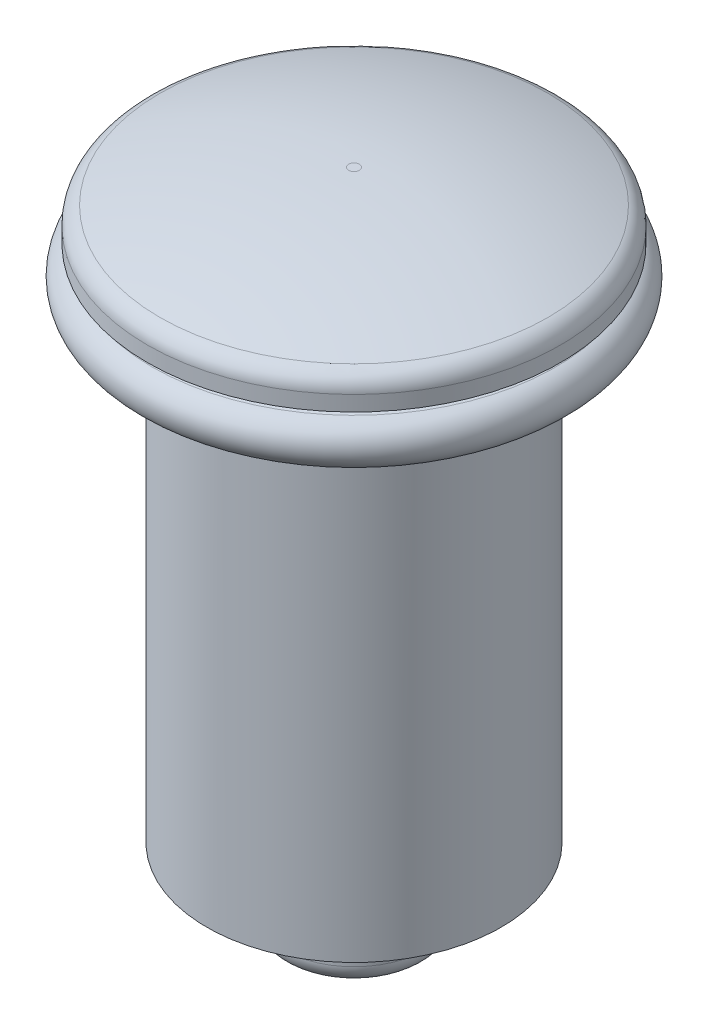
ISO-10303-21;
HEADER;
FILE_DESCRIPTION(('STEP AP214'),'2;1');
FILE_NAME('part.step','',(''),(''),'','','');
FILE_SCHEMA(('AUTOMOTIVE_DESIGN { 1 0 10303 214 1 1 1 1 }'));
ENDSEC;
DATA;
#1=APPLICATION_CONTEXT('core data for automotive mechanical design processes');
#2=APPLICATION_PROTOCOL_DEFINITION('international standard','automotive_design',2000,#1);
#3=PRODUCT_CONTEXT('',#1,'mechanical');
#4=PRODUCT('Part','Part','',(#3));
#5=PRODUCT_RELATED_PRODUCT_CATEGORY('part','',(#4));
#6=PRODUCT_DEFINITION_FORMATION('','',#4);
#7=PRODUCT_DEFINITION_CONTEXT('part definition',#1,'design');
#8=PRODUCT_DEFINITION('design','',#6,#7);
#9=PRODUCT_DEFINITION_SHAPE('','',#8);
#10=(LENGTH_UNIT() NAMED_UNIT(*) SI_UNIT(.MILLI.,.METRE.));
#11=(NAMED_UNIT(*) PLANE_ANGLE_UNIT() SI_UNIT($,.RADIAN.));
#12=(NAMED_UNIT(*) SI_UNIT($,.STERADIAN.) SOLID_ANGLE_UNIT());
#13=UNCERTAINTY_MEASURE_WITH_UNIT(LENGTH_MEASURE(1.E-05),#10,'distance_accuracy_value','');
#14=(GEOMETRIC_REPRESENTATION_CONTEXT(3) GLOBAL_UNCERTAINTY_ASSIGNED_CONTEXT((#13)) GLOBAL_UNIT_ASSIGNED_CONTEXT((#10,
#11,#12)) REPRESENTATION_CONTEXT('',''));
#15=CARTESIAN_POINT('',(0.,0.,0.));
#16=DIRECTION('',(0.,0.,1.));
#17=DIRECTION('',(1.,0.,0.));
#18=AXIS2_PLACEMENT_3D('',#15,#16,#17);
#19=CARTESIAN_POINT('',(0.,-6.985,0.));
#20=DIRECTION('',(0.,-1.,0.));
#21=DIRECTION('',(0.,0.,-1.));
#22=AXIS2_PLACEMENT_3D('',#19,#20,#21);
#23=PLANE('',#22);
#24=CARTESIAN_POINT('',(0.,-6.985,0.));
#25=DIRECTION('',(0.,-1.,0.));
#26=DIRECTION('',(0.,0.,-1.));
#27=AXIS2_PLACEMENT_3D('',#24,#25,#26);
#28=CIRCLE('',#27,1.9812);
#29=CARTESIAN_POINT('',(0.,-6.985,-1.9812));
#30=VERTEX_POINT('',#29);
#31=EDGE_CURVE('E61',#30,#30,#28,.T.);
#32=ORIENTED_EDGE('',*,*,#31,.T.);
#33=EDGE_LOOP('',(#32));
#34=FACE_BOUND('',#33,.T.);
#35=CARTESIAN_POINT('',(0.,-6.985,0.));
#36=DIRECTION('',(0.,-1.,0.));
#37=DIRECTION('',(0.,0.,-1.));
#38=AXIS2_PLACEMENT_3D('',#35,#36,#37);
#39=CIRCLE('',#38,0.973081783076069);
#40=CARTESIAN_POINT('',(0.,-6.985,-0.973081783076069));
#41=VERTEX_POINT('',#40);
#42=EDGE_CURVE('E76',#41,#41,#39,.T.);
#43=ORIENTED_EDGE('',*,*,#42,.F.);
#44=EDGE_LOOP('',(#43));
#45=FACE_BOUND('',#44,.T.);
#46=ADVANCED_FACE('F35',(#34,#45),#23,.T.);
#47=CARTESIAN_POINT('',(0.,0.,-1.9812));
#48=DIRECTION('',(0.,-1.,0.));
#49=DIRECTION('',(0.,0.,-1.));
#50=AXIS2_PLACEMENT_3D('',#47,#48,#49);
#51=PLANE('',#50);
#52=CARTESIAN_POINT('',(0.,0.,0.));
#53=DIRECTION('',(0.,-1.,0.));
#54=DIRECTION('',(0.,0.,-1.));
#55=AXIS2_PLACEMENT_3D('',#52,#53,#54);
#56=CIRCLE('',#55,2.7813);
#57=CARTESIAN_POINT('',(0.,0.,-2.7813));
#58=VERTEX_POINT('',#57);
#59=EDGE_CURVE('E58',#58,#58,#56,.T.);
#60=ORIENTED_EDGE('',*,*,#59,.T.);
#61=EDGE_LOOP('',(#60));
#62=FACE_BOUND('',#61,.T.);
#63=CARTESIAN_POINT('',(0.,0.,0.));
#64=DIRECTION('',(0.,1.,0.));
#65=DIRECTION('',(0.,0.,1.));
#66=AXIS2_PLACEMENT_3D('',#63,#64,#65);
#67=CIRCLE('',#66,2.46146872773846);
#68=CARTESIAN_POINT('',(0.,0.,2.46146872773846));
#69=VERTEX_POINT('',#68);
#70=EDGE_CURVE('E64',#69,#69,#67,.T.);
#71=ORIENTED_EDGE('',*,*,#70,.T.);
#72=EDGE_LOOP('',(#71));
#73=FACE_BOUND('',#72,.T.);
#74=ADVANCED_FACE('F83',(#62,#73),#51,.T.);
#75=CARTESIAN_POINT('',(0.,0.889,0.));
#76=DIRECTION('',(0.,1.,0.));
#77=DIRECTION('',(0.,0.,1.));
#78=AXIS2_PLACEMENT_3D('',#75,#76,#77);
#79=PLANE('',#78);
#80=CARTESIAN_POINT('',(0.,0.889,0.));
#81=DIRECTION('',(0.,-1.,0.));
#82=DIRECTION('',(0.,0.,-1.));
#83=AXIS2_PLACEMENT_3D('',#80,#81,#82);
#84=CIRCLE('',#83,0.071932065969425);
#85=CARTESIAN_POINT('',(0.,0.889,-0.071932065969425));
#86=VERTEX_POINT('',#85);
#87=EDGE_CURVE('E55',#86,#86,#84,.T.);
#88=ORIENTED_EDGE('',*,*,#87,.F.);
#89=EDGE_LOOP('',(#88));
#90=FACE_BOUND('',#89,.T.);
#91=ADVANCED_FACE('F89',(#90),#79,.T.);
#92=CARTESIAN_POINT('',(0.,-6.5900734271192,0.));
#93=DIRECTION('',(0.,-1.,0.));
#94=DIRECTION('',(0.,0.,-1.));
#95=AXIS2_PLACEMENT_3D('',#92,#93,#94);
#96=DEGENERATE_TOROIDAL_SURFACE('',#95,0.071932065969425,7.4790734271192,.T.);
#97=CARTESIAN_POINT('',(0.,0.443870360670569,0.));
#98=DIRECTION('',(0.,-1.,0.));
#99=DIRECTION('',(0.,0.,-1.));
#100=AXIS2_PLACEMENT_3D('',#97,#98,#99);
#101=CIRCLE('',#100,2.61361932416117);
#102=CARTESIAN_POINT('',(0.,0.443870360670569,-2.61361932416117));
#103=VERTEX_POINT('',#102);
#104=EDGE_CURVE('E46',#103,#103,#101,.F.);
#105=ORIENTED_EDGE('',*,*,#104,.T.);
#106=EDGE_LOOP('',(#105));
#107=FACE_BOUND('',#106,.T.);
#108=ORIENTED_EDGE('',*,*,#87,.T.);
#109=EDGE_LOOP('',(#108));
#110=FACE_BOUND('',#109,.T.);
#111=ADVANCED_FACE('F105',(#107,#110),#96,.T.);
#112=CARTESIAN_POINT('',(0.,0.,0.));
#113=DIRECTION('',(0.,-1.,0.));
#114=DIRECTION('',(0.,0.,-1.));
#115=AXIS2_PLACEMENT_3D('',#112,#113,#114);
#116=CYLINDRICAL_SURFACE('',#115,2.7813);
#117=CARTESIAN_POINT('',(0.,0.204987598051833,0.));
#118=DIRECTION('',(0.,1.,0.));
#119=DIRECTION('',(0.,0.,1.));
#120=AXIS2_PLACEMENT_3D('',#117,#118,#119);
#121=CIRCLE('',#120,2.7813);
#122=CARTESIAN_POINT('',(0.,0.204987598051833,2.7813));
#123=VERTEX_POINT('',#122);
#124=EDGE_CURVE('E50',#123,#123,#121,.F.);
#125=ORIENTED_EDGE('',*,*,#124,.T.);
#126=EDGE_LOOP('',(#125));
#127=FACE_BOUND('',#126,.T.);
#128=ORIENTED_EDGE('',*,*,#59,.F.);
#129=EDGE_LOOP('',(#128));
#130=FACE_BOUND('',#129,.T.);
#131=ADVANCED_FACE('F101',(#127,#130),#116,.T.);
#132=CARTESIAN_POINT('',(0.,0.204987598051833,0.));
#133=DIRECTION('',(0.,1.,0.));
#134=DIRECTION('',(0.,0.,1.));
#135=AXIS2_PLACEMENT_3D('',#132,#133,#134);
#136=TOROIDAL_SURFACE('',#135,2.5273,0.254);
#137=ORIENTED_EDGE('',*,*,#104,.F.);
#138=EDGE_LOOP('',(#137));
#139=FACE_BOUND('',#138,.T.);
#140=ORIENTED_EDGE('',*,*,#124,.F.);
#141=EDGE_LOOP('',(#140));
#142=FACE_BOUND('',#141,.T.);
#143=ADVANCED_FACE('F104',(#139,#142),#136,.T.);
#144=CARTESIAN_POINT('',(0.,-0.0833956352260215,0.));
#145=DIRECTION('',(0.,-1.,0.));
#146=DIRECTION('',(0.,0.,-1.));
#147=AXIS2_PLACEMENT_3D('',#144,#145,#146);
#148=CONICAL_SURFACE('',#147,2.71692855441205,1.25525077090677);
#149=ORIENTED_EDGE('',*,*,#70,.F.);
#150=EDGE_LOOP('',(#149));
#151=FACE_BOUND('',#150,.T.);
#152=CARTESIAN_POINT('',(0.,-0.0833956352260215,0.));
#153=DIRECTION('',(0.,1.,0.));
#154=DIRECTION('',(0.,0.,1.));
#155=AXIS2_PLACEMENT_3D('',#152,#153,#154);
#156=CIRCLE('',#155,2.71692855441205);
#157=CARTESIAN_POINT('',(0.,-0.0833956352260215,2.71692855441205));
#158=VERTEX_POINT('',#157);
#159=EDGE_CURVE('E67',#158,#158,#156,.T.);
#160=ORIENTED_EDGE('',*,*,#159,.T.);
#161=EDGE_LOOP('',(#160));
#162=FACE_BOUND('',#161,.T.);
#163=ADVANCED_FACE('F94',(#151,#162),#148,.T.);
#164=CARTESIAN_POINT('',(0.,-0.3794712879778,0.));
#165=DIRECTION('',(0.,1.,0.));
#166=DIRECTION('',(0.,0.,1.));
#167=AXIS2_PLACEMENT_3D('',#164,#165,#166);
#168=TOROIDAL_SURFACE('',#167,2.6202737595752,0.311452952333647);
#169=ORIENTED_EDGE('',*,*,#159,.F.);
#170=EDGE_LOOP('',(#169));
#171=FACE_BOUND('',#170,.T.);
#172=CARTESIAN_POINT('',(0.,-0.689370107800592,0.));
#173=DIRECTION('',(0.,1.,0.));
#174=DIRECTION('',(0.,0.,1.));
#175=AXIS2_PLACEMENT_3D('',#172,#173,#174);
#176=CIRCLE('',#175,2.58919864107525);
#177=CARTESIAN_POINT('',(0.,-0.689370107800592,2.58919864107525));
#178=VERTEX_POINT('',#177);
#179=EDGE_CURVE('E70',#178,#178,#176,.T.);
#180=ORIENTED_EDGE('',*,*,#179,.T.);
#181=EDGE_LOOP('',(#180));
#182=FACE_BOUND('',#181,.T.);
#183=ADVANCED_FACE('F117',(#171,#182),#168,.T.);
#184=CARTESIAN_POINT('',(0.,-0.689370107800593,-2.58919864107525));
#185=DIRECTION('',(0.,1.,0.));
#186=DIRECTION('',(0.,0.,1.));
#187=AXIS2_PLACEMENT_3D('',#184,#185,#186);
#188=PLANE('',#187);
#189=ORIENTED_EDGE('',*,*,#179,.F.);
#190=EDGE_LOOP('',(#189));
#191=FACE_BOUND('',#190,.T.);
#192=CARTESIAN_POINT('',(0.,-0.689370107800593,0.));
#193=DIRECTION('',(0.,1.,0.));
#194=DIRECTION('',(0.,0.,1.));
#195=AXIS2_PLACEMENT_3D('',#192,#193,#194);
#196=CIRCLE('',#195,1.9812);
#197=CARTESIAN_POINT('',(0.,-0.689370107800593,1.9812));
#198=VERTEX_POINT('',#197);
#199=EDGE_CURVE('E73',#198,#198,#196,.T.);
#200=ORIENTED_EDGE('',*,*,#199,.T.);
#201=EDGE_LOOP('',(#200));
#202=FACE_BOUND('',#201,.T.);
#203=ADVANCED_FACE('F98',(#191,#202),#188,.F.);
#204=CARTESIAN_POINT('',(0.,0.,0.));
#205=DIRECTION('',(0.,-1.,0.));
#206=DIRECTION('',(0.,0.,-1.));
#207=AXIS2_PLACEMENT_3D('',#204,#205,#206);
#208=CYLINDRICAL_SURFACE('',#207,1.9812);
#209=ORIENTED_EDGE('',*,*,#31,.F.);
#210=EDGE_LOOP('',(#209));
#211=FACE_BOUND('',#210,.T.);
#212=ORIENTED_EDGE('',*,*,#199,.F.);
#213=EDGE_LOOP('',(#212));
#214=FACE_BOUND('',#213,.T.);
#215=ADVANCED_FACE('F96',(#211,#214),#208,.T.);
#216=CARTESIAN_POINT('',(0.,-8.001,0.));
#217=DIRECTION('',(0.,1.,0.));
#218=DIRECTION('',(0.,0.,1.));
#219=AXIS2_PLACEMENT_3D('',#216,#217,#218);
#220=CYLINDRICAL_SURFACE('',#219,0.973081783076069);
#221=CARTESIAN_POINT('',(0.,-7.747,0.));
#222=DIRECTION('',(0.,-1.,0.));
#223=DIRECTION('',(0.,0.,-1.));
#224=AXIS2_PLACEMENT_3D('',#221,#222,#223);
#225=CIRCLE('',#224,0.973081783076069);
#226=CARTESIAN_POINT('',(0.,-7.747,-0.973081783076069));
#227=VERTEX_POINT('',#226);
#228=EDGE_CURVE('E10',#227,#227,#225,.F.);
#229=ORIENTED_EDGE('',*,*,#228,.T.);
#230=EDGE_LOOP('',(#229));
#231=FACE_BOUND('',#230,.T.);
#232=ORIENTED_EDGE('',*,*,#42,.T.);
#233=EDGE_LOOP('',(#232));
#234=FACE_BOUND('',#233,.T.);
#235=ADVANCED_FACE('F80',(#231,#234),#220,.T.);
#236=CARTESIAN_POINT('',(0.,-8.001,0.));
#237=DIRECTION('',(0.,-1.,0.));
#238=DIRECTION('',(0.,0.,-1.));
#239=AXIS2_PLACEMENT_3D('',#236,#237,#238);
#240=PLANE('',#239);
#241=CARTESIAN_POINT('',(0.,-8.001,0.));
#242=DIRECTION('',(0.,-1.,0.));
#243=DIRECTION('',(0.,0.,-1.));
#244=AXIS2_PLACEMENT_3D('',#241,#242,#243);
#245=CIRCLE('',#244,0.719081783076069);
#246=CARTESIAN_POINT('',(0.,-8.001,-0.719081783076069));
#247=VERTEX_POINT('',#246);
#248=EDGE_CURVE('E42',#247,#247,#245,.T.);
#249=ORIENTED_EDGE('',*,*,#248,.T.);
#250=EDGE_LOOP('',(#249));
#251=FACE_BOUND('',#250,.T.);
#252=ADVANCED_FACE('F143',(#251),#240,.T.);
#253=CARTESIAN_POINT('',(0.,-7.747,0.));
#254=DIRECTION('',(0.,-1.,0.));
#255=DIRECTION('',(0.,0.,-1.));
#256=AXIS2_PLACEMENT_3D('',#253,#254,#255);
#257=TOROIDAL_SURFACE('',#256,0.719081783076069,0.254);
#258=ORIENTED_EDGE('',*,*,#228,.F.);
#259=EDGE_LOOP('',(#258));
#260=FACE_BOUND('',#259,.T.);
#261=ORIENTED_EDGE('',*,*,#248,.F.);
#262=EDGE_LOOP('',(#261));
#263=FACE_BOUND('',#262,.T.);
#264=ADVANCED_FACE('F37',(#260,#263),#257,.T.);
#265=CLOSED_SHELL('',(#46,#74,#91,#111,#131,#143,#163,#183,#203,#215,#235,#252,#264));
#266=MANIFOLD_SOLID_BREP('B2',#265);
#267=ADVANCED_BREP_SHAPE_REPRESENTATION('',(#18,#266),#14);
#268=SHAPE_DEFINITION_REPRESENTATION(#9,#267);
ENDSEC;
END-ISO-10303-21;
